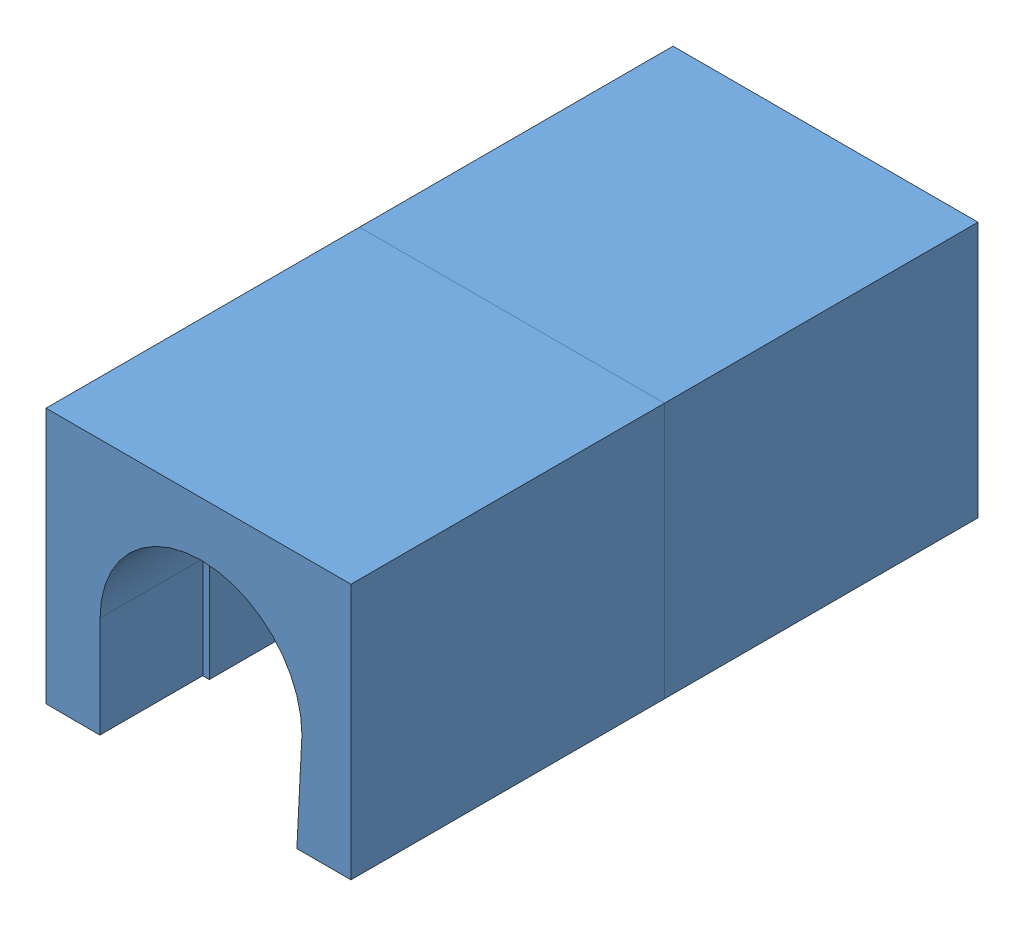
SolidWorks assembly motor assembly.SLDASM, configuration Default (file format 9000). Lengths in mm.
Overall size (56.41 47.4 116).
2 component instances, 1 part files, 3 mates.
Components (placement in the parent):
- motor angle-1: motor angle.SLDPRT [Default] at (57.6801 37.3592 4.636) size (56.41 47.4 58)
- motor angle-2: motor angle.SLDPRT [Default] at (29.2903 37.3592 120.636) x (-1 0 0) z (0 0 -1) size (56.41 47.4 58)
Mates (geometry in assembly coordinates):
- Coincident1: coincident anti-aligned: plane of motor angle-1 through (43.4852 29.5732 62.636) normal (0 0 1); plane of motor angle-2 through (43.4852 29.5732 62.636) normal (0 0 -1)
- Coincident2: coincident: line of motor angle-1 through (19.7352 5.8232 62.636) axis (1 0 0); line of motor angle-2 through (67.2352 5.8232 62.636) axis (-1 0 0)
- Coincident3: coincident: line of motor angle-1 through (67.2352 5.8232 62.636) axis (0 1 0); line of motor angle-2 through (67.2352 53.3232 62.636) axis (0 -1 0)
